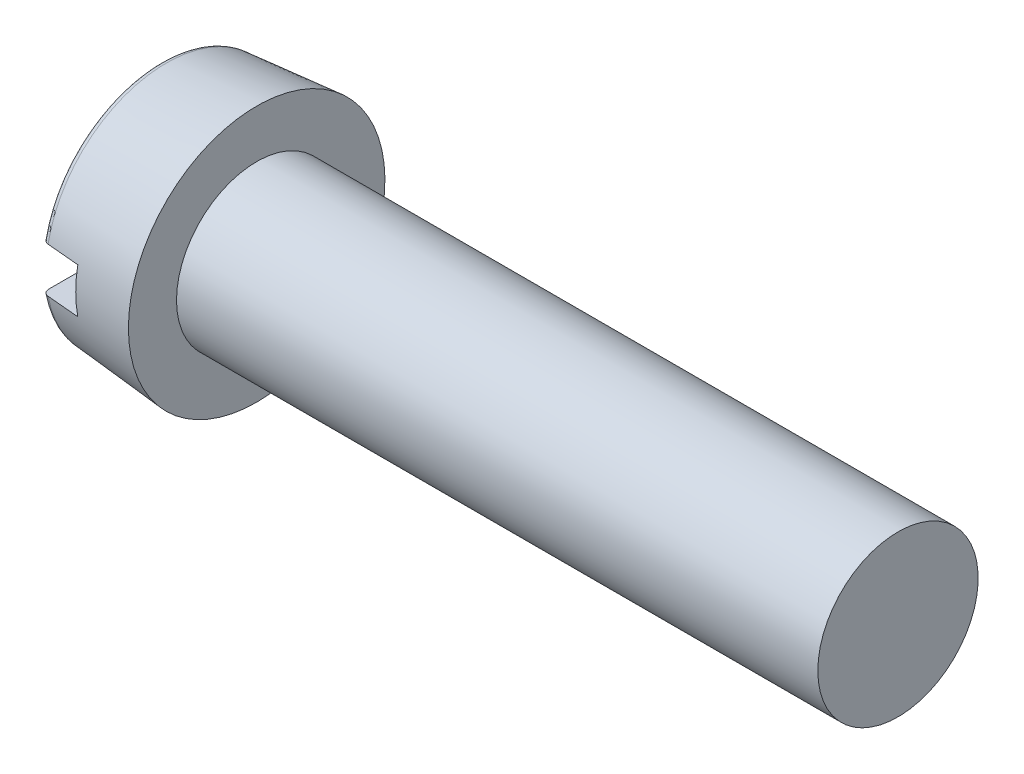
from build123d import *

# Parameters (mm, degrees)
FILLET1_R  = 0.4
SLOTSKE_W  = 16
SLOTSKE_H  = 2.81
SLOT_DEPTH = 2.4


with BuildPart() as part:
    # BodySke → BaseBody (revolve)
    with BuildSketch(Plane.XY, mode=Mode.PRIVATE) as basebody_sk:
        Polygon((0, 0), (0, 7.475068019), (6, 8), (6, 5), (46, 5), (46, 0), align=None)
    revolve(basebody_sk.sketch.rotate(Axis((0, 0, 0), (1, 0, 0)), 90), axis=Axis((0, 0, 0), (1, 0, 0)))

    # Fillet1
    fillet1_edges = [part.edges().sort_by_distance(p)[0] for p in [
        (0, 0, -7.475068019),
    ]]
    fillet(fillet1_edges, radius=FILLET1_R)

    # SlotSke → Slot (cut)
    with BuildSketch(Plane.ZY):
        Rectangle(SLOTSKE_W, SLOTSKE_H)
    extrude(amount=-SLOT_DEPTH, mode=Mode.SUBTRACT)


solid = part.part
